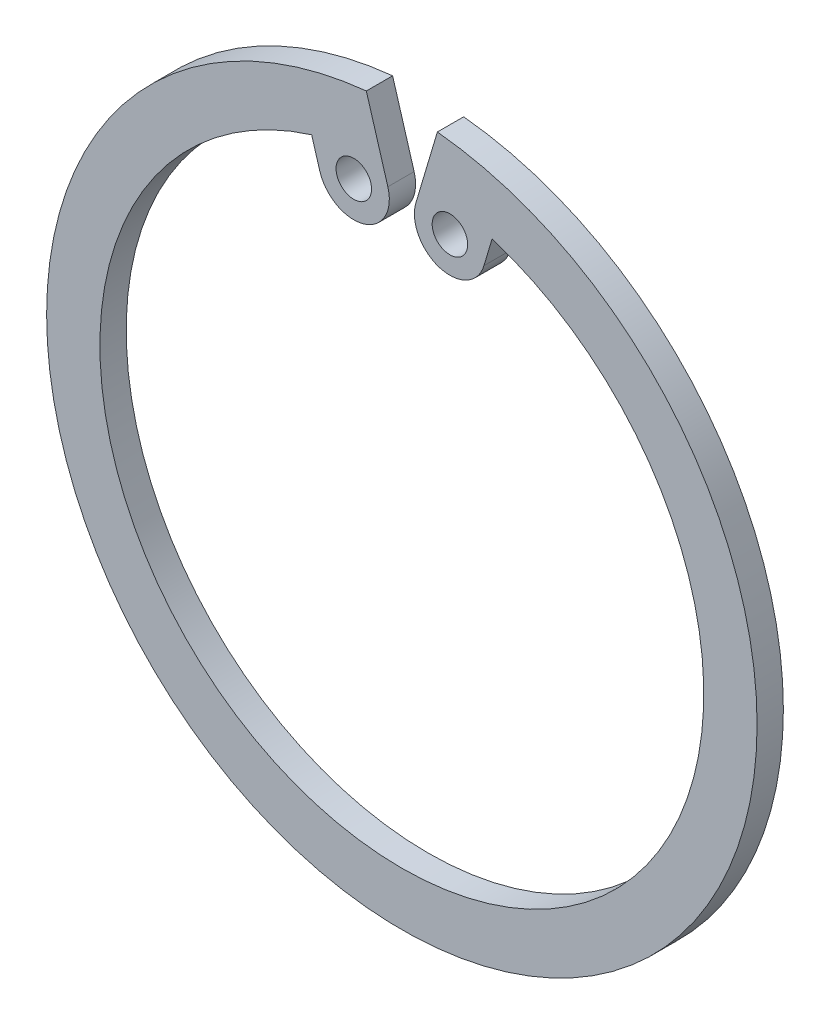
from build123d import *

# Parameters (mm, degrees)
SKETCH1_R          = 1
BASE_EXTRUDE_DEPTH = 1.48


with BuildPart() as part:
    # Sketch1 → Base-Extrude (new body)
    with BuildSketch(Plane.XY):
        with BuildLine():
            Line((0.78896939, 15.832778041), (2, 19.899748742))
            ThreePointArc((2, 19.899748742), (0, -20), (-2, 19.899748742))
            Line((-2, 19.899748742), (-0.78896939, 15.832778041))
            ThreePointArc((-0.78896939, 15.832778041), (-2.135016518, 13.345177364), (-4.622617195, 14.691224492))
            Line((-4.622617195, 14.691224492), (-5.078911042, 16.223583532))
            ThreePointArc((-5.078911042, 16.223583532), (0, -17), (5.078911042, 16.223583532))
            Line((5.078911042, 16.223583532), (4.622617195, 14.691224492))
            ThreePointArc((4.622617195, 14.691224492), (2.135016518, 13.345177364), (0.78896939, 15.832778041))
        make_face()
        with Locations((2.705793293, 15.262001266)):
            Circle(SKETCH1_R, mode=Mode.SUBTRACT)
        with Locations((-2.705793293, 15.262001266)):
            Circle(SKETCH1_R, mode=Mode.SUBTRACT)
    extrude(amount=BASE_EXTRUDE_DEPTH)


solid = part.part
